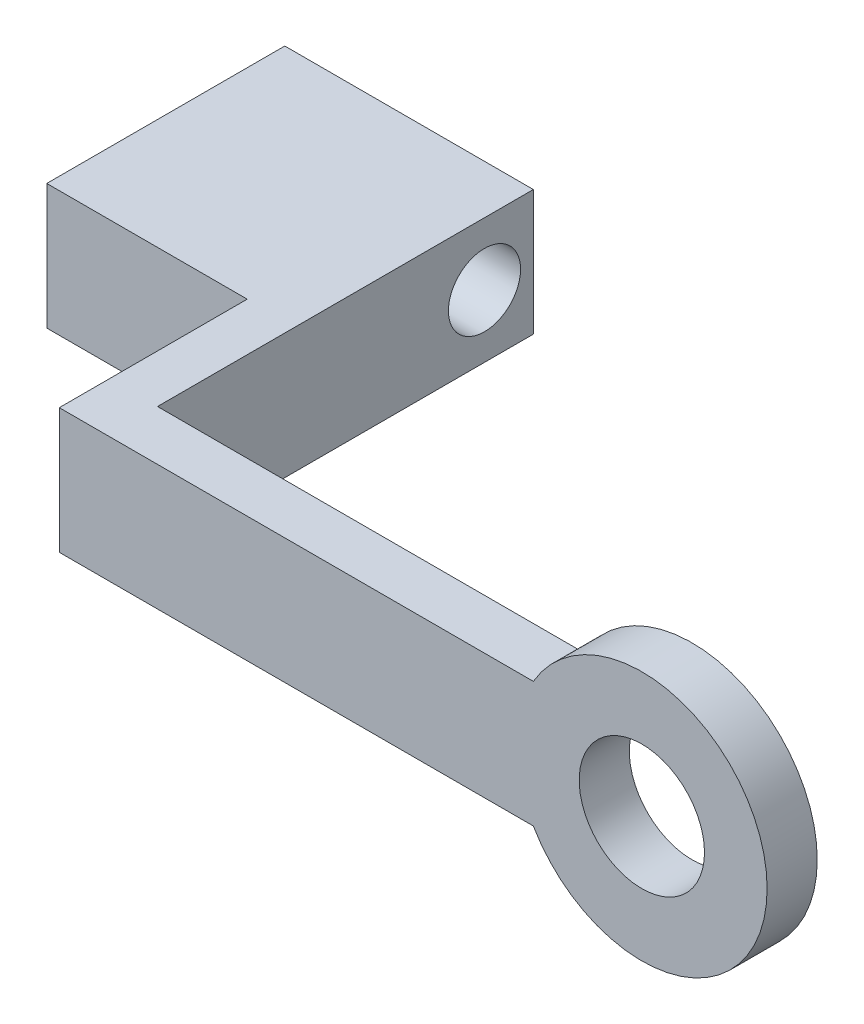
ISO-10303-21;
HEADER;
FILE_DESCRIPTION(('STEP AP214'),'2;1');
FILE_NAME('part.step','',(''),(''),'','','');
FILE_SCHEMA(('AUTOMOTIVE_DESIGN { 1 0 10303 214 1 1 1 1 }'));
ENDSEC;
DATA;
#1=APPLICATION_CONTEXT('core data for automotive mechanical design processes');
#2=APPLICATION_PROTOCOL_DEFINITION('international standard','automotive_design',2000,#1);
#3=PRODUCT_CONTEXT('',#1,'mechanical');
#4=PRODUCT('Part','Part','',(#3));
#5=PRODUCT_RELATED_PRODUCT_CATEGORY('part','',(#4));
#6=PRODUCT_DEFINITION_FORMATION('','',#4);
#7=PRODUCT_DEFINITION_CONTEXT('part definition',#1,'design');
#8=PRODUCT_DEFINITION('design','',#6,#7);
#9=PRODUCT_DEFINITION_SHAPE('','',#8);
#10=(LENGTH_UNIT() NAMED_UNIT(*) SI_UNIT(.MILLI.,.METRE.));
#11=(NAMED_UNIT(*) PLANE_ANGLE_UNIT() SI_UNIT($,.RADIAN.));
#12=(NAMED_UNIT(*) SI_UNIT($,.STERADIAN.) SOLID_ANGLE_UNIT());
#13=UNCERTAINTY_MEASURE_WITH_UNIT(LENGTH_MEASURE(1.E-05),#10,'distance_accuracy_value','');
#14=(GEOMETRIC_REPRESENTATION_CONTEXT(3) GLOBAL_UNCERTAINTY_ASSIGNED_CONTEXT((#13)) GLOBAL_UNIT_ASSIGNED_CONTEXT((#10,
#11,#12)) REPRESENTATION_CONTEXT('',''));
#15=CARTESIAN_POINT('',(0.,0.,0.));
#16=DIRECTION('',(0.,0.,1.));
#17=DIRECTION('',(1.,0.,0.));
#18=AXIS2_PLACEMENT_3D('',#15,#16,#17);
#19=CARTESIAN_POINT('',(0.,0.,2.54));
#20=DIRECTION('',(0.,0.,1.));
#21=DIRECTION('',(1.,0.,0.));
#22=AXIS2_PLACEMENT_3D('',#19,#20,#21);
#23=PLANE('',#22);
#24=CARTESIAN_POINT('',(0.,0.,2.54));
#25=DIRECTION('',(0.,0.,1.));
#26=DIRECTION('',(1.,0.,0.));
#27=AXIS2_PLACEMENT_3D('',#24,#25,#26);
#28=CIRCLE('',#27,3.175);
#29=CARTESIAN_POINT('',(3.175,0.,2.54));
#30=VERTEX_POINT('',#29);
#31=EDGE_CURVE('E149',#30,#30,#28,.T.);
#32=ORIENTED_EDGE('',*,*,#31,.F.);
#33=EDGE_LOOP('',(#32));
#34=FACE_BOUND('',#33,.T.);
#35=DIRECTION('',(-1.,0.,0.));
#36=VECTOR('',#35,1.);
#37=CARTESIAN_POINT('',(-15.6592613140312,3.175,2.54));
#38=LINE('',#37,#36);
#39=CARTESIAN_POINT('',(-5.49926131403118,3.175,2.54));
#40=VERTEX_POINT('',#39);
#41=CARTESIAN_POINT('',(-29.5276613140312,3.175,2.54));
#42=VERTEX_POINT('',#41);
#43=EDGE_CURVE('E159',#40,#42,#38,.T.);
#44=ORIENTED_EDGE('',*,*,#43,.T.);
#45=DIRECTION('',(0.,1.,0.));
#46=VECTOR('',#45,1.);
#47=CARTESIAN_POINT('',(-29.5276613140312,3.175,2.54));
#48=LINE('',#47,#46);
#49=CARTESIAN_POINT('',(-29.5276613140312,-3.175,2.54));
#50=VERTEX_POINT('',#49);
#51=EDGE_CURVE('E117',#50,#42,#48,.T.);
#52=ORIENTED_EDGE('',*,*,#51,.F.);
#53=DIRECTION('',(1.,0.,0.));
#54=VECTOR('',#53,1.);
#55=CARTESIAN_POINT('',(-15.6592613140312,-3.175,2.54));
#56=LINE('',#55,#54);
#57=CARTESIAN_POINT('',(-5.49926131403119,-3.175,2.54));
#58=VERTEX_POINT('',#57);
#59=EDGE_CURVE('E116',#50,#58,#56,.T.);
#60=ORIENTED_EDGE('',*,*,#59,.T.);
#61=CARTESIAN_POINT('',(0.,0.,2.54));
#62=DIRECTION('',(0.,0.,1.));
#63=DIRECTION('',(1.,0.,0.));
#64=AXIS2_PLACEMENT_3D('',#61,#62,#63);
#65=CIRCLE('',#64,6.35);
#66=EDGE_CURVE('E156',#58,#40,#65,.T.);
#67=ORIENTED_EDGE('',*,*,#66,.T.);
#68=EDGE_LOOP('',(#44,#52,#60,#67));
#69=FACE_BOUND('',#68,.T.);
#70=ADVANCED_FACE('F31',(#34,#69),#23,.T.);
#71=CARTESIAN_POINT('',(-39.6876613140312,3.175,-19.05));
#72=DIRECTION('',(0.,0.,1.));
#73=DIRECTION('',(1.,0.,0.));
#74=AXIS2_PLACEMENT_3D('',#71,#72,#73);
#75=PLANE('',#74);
#76=DIRECTION('',(0.,1.,0.));
#77=VECTOR('',#76,1.);
#78=CARTESIAN_POINT('',(-27.0892613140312,3.175,-19.05));
#79=LINE('',#78,#77);
#80=CARTESIAN_POINT('',(-27.0892613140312,-3.175,-19.05));
#81=VERTEX_POINT('',#80);
#82=CARTESIAN_POINT('',(-27.0892613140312,3.175,-19.05));
#83=VERTEX_POINT('',#82);
#84=EDGE_CURVE('E127',#81,#83,#79,.T.);
#85=ORIENTED_EDGE('',*,*,#84,.F.);
#86=DIRECTION('',(1.,0.,0.));
#87=VECTOR('',#86,1.);
#88=CARTESIAN_POINT('',(-39.6876613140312,-3.175,-19.05));
#89=LINE('',#88,#87);
#90=CARTESIAN_POINT('',(-39.6876613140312,-3.175,-19.05));
#91=VERTEX_POINT('',#90);
#92=EDGE_CURVE('E145',#91,#81,#89,.T.);
#93=ORIENTED_EDGE('',*,*,#92,.F.);
#94=DIRECTION('',(0.,-1.,0.));
#95=VECTOR('',#94,1.);
#96=CARTESIAN_POINT('',(-39.6876613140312,3.175,-19.05));
#97=LINE('',#96,#95);
#98=CARTESIAN_POINT('',(-39.6876613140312,3.175,-19.05));
#99=VERTEX_POINT('',#98);
#100=EDGE_CURVE('E135',#99,#91,#97,.T.);
#101=ORIENTED_EDGE('',*,*,#100,.F.);
#102=DIRECTION('',(1.,0.,0.));
#103=VECTOR('',#102,1.);
#104=CARTESIAN_POINT('',(-39.6876613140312,3.175,-19.05));
#105=LINE('',#104,#103);
#106=EDGE_CURVE('E142',#99,#83,#105,.T.);
#107=ORIENTED_EDGE('',*,*,#106,.T.);
#108=EDGE_LOOP('',(#85,#93,#101,#107));
#109=FACE_BOUND('',#108,.T.);
#110=ADVANCED_FACE('F186',(#109),#75,.F.);
#111=CARTESIAN_POINT('',(-39.6876613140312,0.,-16.5735));
#112=DIRECTION('',(1.,0.,0.));
#113=DIRECTION('',(0.,0.,-1.));
#114=AXIS2_PLACEMENT_3D('',#111,#112,#113);
#115=CYLINDRICAL_SURFACE('',#114,1.8288);
#116=CARTESIAN_POINT('',(-39.6876613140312,0.,-16.5735));
#117=DIRECTION('',(-1.,0.,0.));
#118=DIRECTION('',(0.,0.,1.));
#119=AXIS2_PLACEMENT_3D('',#116,#117,#118);
#120=CIRCLE('',#119,1.8288);
#121=CARTESIAN_POINT('',(-39.6876613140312,0.,-14.7447));
#122=VERTEX_POINT('',#121);
#123=EDGE_CURVE('E132',#122,#122,#120,.T.);
#124=ORIENTED_EDGE('',*,*,#123,.T.);
#125=EDGE_LOOP('',(#124));
#126=FACE_BOUND('',#125,.T.);
#127=CARTESIAN_POINT('',(-27.0892613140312,0.,-16.5735));
#128=DIRECTION('',(1.,0.,0.));
#129=DIRECTION('',(0.,0.,-1.));
#130=AXIS2_PLACEMENT_3D('',#127,#128,#129);
#131=CIRCLE('',#130,1.8288);
#132=CARTESIAN_POINT('',(-27.0892613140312,0.,-18.4023));
#133=VERTEX_POINT('',#132);
#134=EDGE_CURVE('E35',#133,#133,#131,.T.);
#135=ORIENTED_EDGE('',*,*,#134,.T.);
#136=EDGE_LOOP('',(#135));
#137=FACE_BOUND('',#136,.T.);
#138=ADVANCED_FACE('F208',(#126,#137),#115,.F.);
#139=CARTESIAN_POINT('',(0.,0.,0.));
#140=DIRECTION('',(0.,0.,1.));
#141=DIRECTION('',(1.,0.,0.));
#142=AXIS2_PLACEMENT_3D('',#139,#140,#141);
#143=PLANE('',#142);
#144=DIRECTION('',(1.,0.,0.));
#145=VECTOR('',#144,1.);
#146=CARTESIAN_POINT('',(-15.6592613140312,-3.175,0.));
#147=LINE('',#146,#145);
#148=CARTESIAN_POINT('',(-27.0892613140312,-3.175,0.));
#149=VERTEX_POINT('',#148);
#150=CARTESIAN_POINT('',(-5.49926131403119,-3.175,0.));
#151=VERTEX_POINT('',#150);
#152=EDGE_CURVE('E152',#149,#151,#147,.T.);
#153=ORIENTED_EDGE('',*,*,#152,.F.);
#154=DIRECTION('',(0.,-1.,0.));
#155=VECTOR('',#154,1.);
#156=CARTESIAN_POINT('',(-27.0892613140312,3.175,0.));
#157=LINE('',#156,#155);
#158=CARTESIAN_POINT('',(-27.0892613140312,3.175,0.));
#159=VERTEX_POINT('',#158);
#160=EDGE_CURVE('E123',#159,#149,#157,.T.);
#161=ORIENTED_EDGE('',*,*,#160,.F.);
#162=DIRECTION('',(-1.,0.,0.));
#163=VECTOR('',#162,1.);
#164=CARTESIAN_POINT('',(-15.6592613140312,3.175,0.));
#165=LINE('',#164,#163);
#166=CARTESIAN_POINT('',(-5.49926131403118,3.175,0.));
#167=VERTEX_POINT('',#166);
#168=EDGE_CURVE('E157',#167,#159,#165,.T.);
#169=ORIENTED_EDGE('',*,*,#168,.F.);
#170=CARTESIAN_POINT('',(0.,0.,0.));
#171=DIRECTION('',(0.,0.,1.));
#172=DIRECTION('',(1.,0.,0.));
#173=AXIS2_PLACEMENT_3D('',#170,#171,#172);
#174=CIRCLE('',#173,6.35);
#175=EDGE_CURVE('E162',#151,#167,#174,.T.);
#176=ORIENTED_EDGE('',*,*,#175,.F.);
#177=EDGE_LOOP('',(#153,#161,#169,#176));
#178=FACE_BOUND('',#177,.T.);
#179=CARTESIAN_POINT('',(0.,0.,0.));
#180=DIRECTION('',(0.,0.,1.));
#181=DIRECTION('',(1.,0.,0.));
#182=AXIS2_PLACEMENT_3D('',#179,#180,#181);
#183=CIRCLE('',#182,3.175);
#184=CARTESIAN_POINT('',(3.175,0.,0.));
#185=VERTEX_POINT('',#184);
#186=EDGE_CURVE('E148',#185,#185,#183,.T.);
#187=ORIENTED_EDGE('',*,*,#186,.T.);
#188=EDGE_LOOP('',(#187));
#189=FACE_BOUND('',#188,.T.);
#190=ADVANCED_FACE('F181',(#178,#189),#143,.F.);
#191=CARTESIAN_POINT('',(-15.6592613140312,-3.175,2.54));
#192=DIRECTION('',(0.,1.,0.));
#193=DIRECTION('',(0.,0.,1.));
#194=AXIS2_PLACEMENT_3D('',#191,#192,#193);
#195=PLANE('',#194);
#196=DIRECTION('',(0.,0.,1.));
#197=VECTOR('',#196,1.);
#198=CARTESIAN_POINT('',(-29.5276613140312,-3.175,-6.985));
#199=LINE('',#198,#197);
#200=CARTESIAN_POINT('',(-29.5276613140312,-3.175,-6.985));
#201=VERTEX_POINT('',#200);
#202=EDGE_CURVE('E110',#201,#50,#199,.T.);
#203=ORIENTED_EDGE('',*,*,#202,.F.);
#204=DIRECTION('',(-1.,0.,0.));
#205=VECTOR('',#204,1.);
#206=CARTESIAN_POINT('',(-29.5276613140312,-3.175,-6.985));
#207=LINE('',#206,#205);
#208=CARTESIAN_POINT('',(-39.6876613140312,-3.175,-6.985));
#209=VERTEX_POINT('',#208);
#210=EDGE_CURVE('E97',#201,#209,#207,.T.);
#211=ORIENTED_EDGE('',*,*,#210,.T.);
#212=DIRECTION('',(0.,0.,1.));
#213=VECTOR('',#212,1.);
#214=CARTESIAN_POINT('',(-39.6876613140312,-3.175,-19.05));
#215=LINE('',#214,#213);
#216=EDGE_CURVE('E138',#91,#209,#215,.T.);
#217=ORIENTED_EDGE('',*,*,#216,.F.);
#218=ORIENTED_EDGE('',*,*,#92,.T.);
#219=DIRECTION('',(0.,0.,-1.));
#220=VECTOR('',#219,1.);
#221=CARTESIAN_POINT('',(-27.0892613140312,-3.175,0.));
#222=LINE('',#221,#220);
#223=EDGE_CURVE('E56',#149,#81,#222,.T.);
#224=ORIENTED_EDGE('',*,*,#223,.F.);
#225=ORIENTED_EDGE('',*,*,#152,.T.);
#226=DIRECTION('',(0.,0.,-1.));
#227=VECTOR('',#226,1.);
#228=CARTESIAN_POINT('',(-5.49926131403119,-3.175,2.54));
#229=LINE('',#228,#227);
#230=EDGE_CURVE('E11',#58,#151,#229,.T.);
#231=ORIENTED_EDGE('',*,*,#230,.F.);
#232=ORIENTED_EDGE('',*,*,#59,.F.);
#233=EDGE_LOOP('',(#203,#211,#217,#218,#224,#225,#231,#232));
#234=FACE_BOUND('',#233,.T.);
#235=ADVANCED_FACE('F33',(#234),#195,.F.);
#236=CARTESIAN_POINT('',(0.,0.,2.54));
#237=DIRECTION('',(0.,0.,-1.));
#238=DIRECTION('',(-1.,0.,0.));
#239=AXIS2_PLACEMENT_3D('',#236,#237,#238);
#240=CYLINDRICAL_SURFACE('',#239,6.35);
#241=ORIENTED_EDGE('',*,*,#175,.T.);
#242=DIRECTION('',(0.,0.,-1.));
#243=VECTOR('',#242,1.);
#244=CARTESIAN_POINT('',(-5.49926131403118,3.175,2.54));
#245=LINE('',#244,#243);
#246=EDGE_CURVE('E40',#40,#167,#245,.T.);
#247=ORIENTED_EDGE('',*,*,#246,.F.);
#248=ORIENTED_EDGE('',*,*,#66,.F.);
#249=ORIENTED_EDGE('',*,*,#230,.T.);
#250=EDGE_LOOP('',(#241,#247,#248,#249));
#251=FACE_BOUND('',#250,.T.);
#252=ADVANCED_FACE('F194',(#251),#240,.T.);
#253=CARTESIAN_POINT('',(-15.6592613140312,3.175,2.54));
#254=DIRECTION('',(0.,-1.,0.));
#255=DIRECTION('',(0.,0.,-1.));
#256=AXIS2_PLACEMENT_3D('',#253,#254,#255);
#257=PLANE('',#256);
#258=DIRECTION('',(0.,0.,-1.));
#259=VECTOR('',#258,1.);
#260=CARTESIAN_POINT('',(-39.6876613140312,3.175,-19.05));
#261=LINE('',#260,#259);
#262=CARTESIAN_POINT('',(-39.6876613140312,3.175,-6.985));
#263=VERTEX_POINT('',#262);
#264=EDGE_CURVE('E140',#263,#99,#261,.T.);
#265=ORIENTED_EDGE('',*,*,#264,.F.);
#266=DIRECTION('',(-1.,0.,0.));
#267=VECTOR('',#266,1.);
#268=CARTESIAN_POINT('',(-29.5276613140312,3.175,-6.985));
#269=LINE('',#268,#267);
#270=CARTESIAN_POINT('',(-29.5276613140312,3.175,-6.985));
#271=VERTEX_POINT('',#270);
#272=EDGE_CURVE('E48',#271,#263,#269,.T.);
#273=ORIENTED_EDGE('',*,*,#272,.F.);
#274=DIRECTION('',(0.,0.,-1.));
#275=VECTOR('',#274,1.);
#276=CARTESIAN_POINT('',(-29.5276613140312,3.175,-6.985));
#277=LINE('',#276,#275);
#278=EDGE_CURVE('E106',#42,#271,#277,.T.);
#279=ORIENTED_EDGE('',*,*,#278,.F.);
#280=ORIENTED_EDGE('',*,*,#43,.F.);
#281=ORIENTED_EDGE('',*,*,#246,.T.);
#282=ORIENTED_EDGE('',*,*,#168,.T.);
#283=DIRECTION('',(0.,0.,1.));
#284=VECTOR('',#283,1.);
#285=CARTESIAN_POINT('',(-27.0892613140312,3.175,0.));
#286=LINE('',#285,#284);
#287=EDGE_CURVE('E129',#83,#159,#286,.T.);
#288=ORIENTED_EDGE('',*,*,#287,.F.);
#289=ORIENTED_EDGE('',*,*,#106,.F.);
#290=EDGE_LOOP('',(#265,#273,#279,#280,#281,#282,#288,#289));
#291=FACE_BOUND('',#290,.T.);
#292=ADVANCED_FACE('F175',(#291),#257,.F.);
#293=CARTESIAN_POINT('',(0.,0.,2.54));
#294=DIRECTION('',(0.,0.,-1.));
#295=DIRECTION('',(-1.,0.,0.));
#296=AXIS2_PLACEMENT_3D('',#293,#294,#295);
#297=CYLINDRICAL_SURFACE('',#296,3.175);
#298=ORIENTED_EDGE('',*,*,#31,.T.);
#299=EDGE_LOOP('',(#298));
#300=FACE_BOUND('',#299,.T.);
#301=ORIENTED_EDGE('',*,*,#186,.F.);
#302=EDGE_LOOP('',(#301));
#303=FACE_BOUND('',#302,.T.);
#304=ADVANCED_FACE('F200',(#300,#303),#297,.F.);
#305=CARTESIAN_POINT('',(-39.6876613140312,-3.175,-19.05));
#306=DIRECTION('',(-1.,0.,0.));
#307=DIRECTION('',(0.,0.,1.));
#308=AXIS2_PLACEMENT_3D('',#305,#306,#307);
#309=PLANE('',#308);
#310=DIRECTION('',(0.,-1.,0.));
#311=VECTOR('',#310,1.);
#312=CARTESIAN_POINT('',(-39.6876613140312,3.175,-6.985));
#313=LINE('',#312,#311);
#314=EDGE_CURVE('E102',#263,#209,#313,.T.);
#315=ORIENTED_EDGE('',*,*,#314,.F.);
#316=ORIENTED_EDGE('',*,*,#264,.T.);
#317=ORIENTED_EDGE('',*,*,#100,.T.);
#318=ORIENTED_EDGE('',*,*,#216,.T.);
#319=EDGE_LOOP('',(#315,#316,#317,#318));
#320=FACE_BOUND('',#319,.T.);
#321=ORIENTED_EDGE('',*,*,#123,.F.);
#322=EDGE_LOOP('',(#321));
#323=FACE_BOUND('',#322,.T.);
#324=ADVANCED_FACE('F189',(#320,#323),#309,.T.);
#325=CARTESIAN_POINT('',(-27.0892613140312,-3.175,0.));
#326=DIRECTION('',(1.,0.,0.));
#327=DIRECTION('',(0.,0.,-1.));
#328=AXIS2_PLACEMENT_3D('',#325,#326,#327);
#329=PLANE('',#328);
#330=ORIENTED_EDGE('',*,*,#134,.F.);
#331=EDGE_LOOP('',(#330));
#332=FACE_BOUND('',#331,.T.);
#333=ORIENTED_EDGE('',*,*,#160,.T.);
#334=ORIENTED_EDGE('',*,*,#223,.T.);
#335=ORIENTED_EDGE('',*,*,#84,.T.);
#336=ORIENTED_EDGE('',*,*,#287,.T.);
#337=EDGE_LOOP('',(#333,#334,#335,#336));
#338=FACE_BOUND('',#337,.T.);
#339=ADVANCED_FACE('F183',(#332,#338),#329,.T.);
#340=CARTESIAN_POINT('',(-29.5276613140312,3.175,-6.985));
#341=DIRECTION('',(0.,0.,-1.));
#342=DIRECTION('',(0.,1.,0.));
#343=AXIS2_PLACEMENT_3D('',#340,#341,#342);
#344=PLANE('',#343);
#345=ORIENTED_EDGE('',*,*,#314,.T.);
#346=ORIENTED_EDGE('',*,*,#210,.F.);
#347=DIRECTION('',(0.,-1.,0.));
#348=VECTOR('',#347,1.);
#349=CARTESIAN_POINT('',(-29.5276613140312,3.175,-6.985));
#350=LINE('',#349,#348);
#351=EDGE_CURVE('E100',#271,#201,#350,.T.);
#352=ORIENTED_EDGE('',*,*,#351,.F.);
#353=ORIENTED_EDGE('',*,*,#272,.T.);
#354=EDGE_LOOP('',(#345,#346,#352,#353));
#355=FACE_BOUND('',#354,.T.);
#356=ADVANCED_FACE('F99',(#355),#344,.F.);
#357=CARTESIAN_POINT('',(-29.5276613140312,-3.175,-6.985));
#358=DIRECTION('',(-1.,0.,0.));
#359=DIRECTION('',(0.,0.,1.));
#360=AXIS2_PLACEMENT_3D('',#357,#358,#359);
#361=PLANE('',#360);
#362=ORIENTED_EDGE('',*,*,#351,.T.);
#363=ORIENTED_EDGE('',*,*,#202,.T.);
#364=ORIENTED_EDGE('',*,*,#51,.T.);
#365=ORIENTED_EDGE('',*,*,#278,.T.);
#366=EDGE_LOOP('',(#362,#363,#364,#365));
#367=FACE_BOUND('',#366,.T.);
#368=ADVANCED_FACE('F109',(#367),#361,.T.);
#369=CLOSED_SHELL('',(#70,#110,#138,#190,#235,#252,#292,#304,#324,#339,#356,#368));
#370=MANIFOLD_SOLID_BREP('B2',#369);
#371=ADVANCED_BREP_SHAPE_REPRESENTATION('',(#18,#370),#14);
#372=SHAPE_DEFINITION_REPRESENTATION(#9,#371);
ENDSEC;
END-ISO-10303-21;
